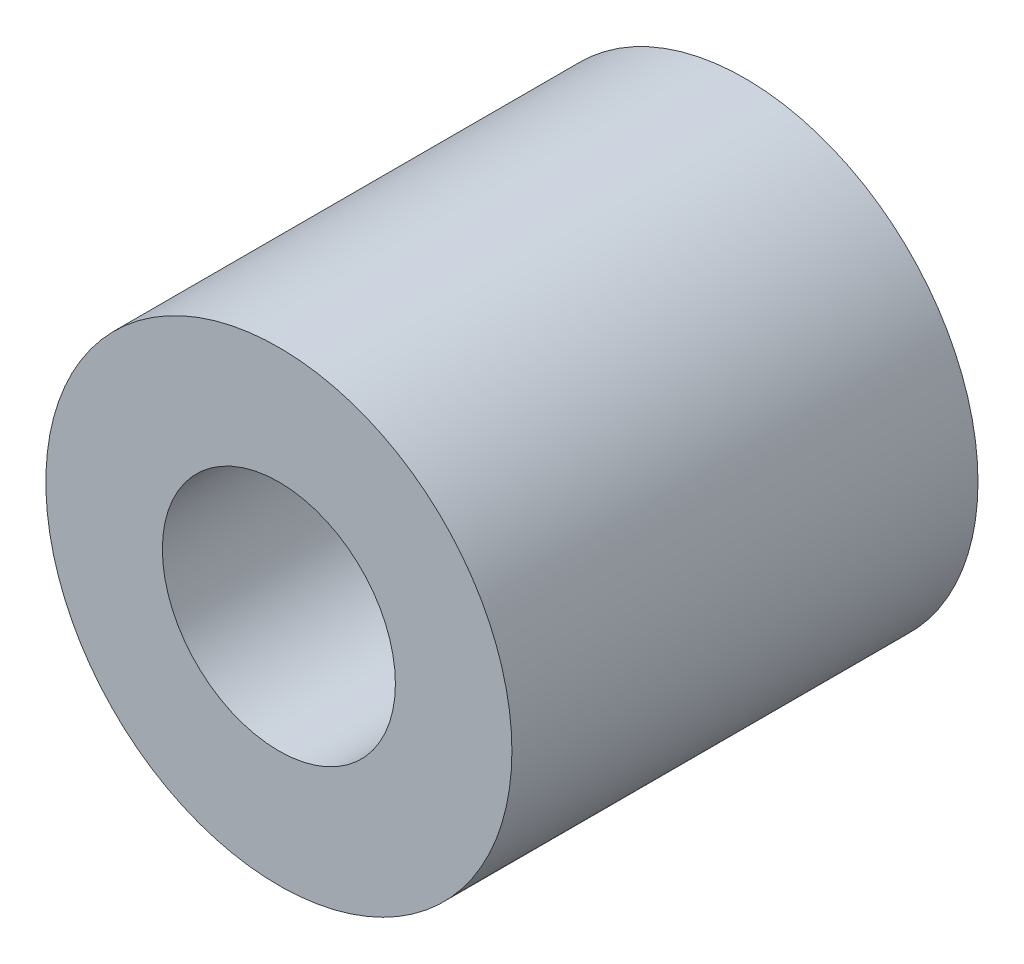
ISO-10303-21;
HEADER;
FILE_DESCRIPTION(('STEP AP214'),'2;1');
FILE_NAME('part.step','',(''),(''),'','','');
FILE_SCHEMA(('AUTOMOTIVE_DESIGN { 1 0 10303 214 1 1 1 1 }'));
ENDSEC;
DATA;
#1=APPLICATION_CONTEXT('core data for automotive mechanical design processes');
#2=APPLICATION_PROTOCOL_DEFINITION('international standard','automotive_design',2000,#1);
#3=PRODUCT_CONTEXT('',#1,'mechanical');
#4=PRODUCT('Part','Part','',(#3));
#5=PRODUCT_RELATED_PRODUCT_CATEGORY('part','',(#4));
#6=PRODUCT_DEFINITION_FORMATION('','',#4);
#7=PRODUCT_DEFINITION_CONTEXT('part definition',#1,'design');
#8=PRODUCT_DEFINITION('design','',#6,#7);
#9=PRODUCT_DEFINITION_SHAPE('','',#8);
#10=(LENGTH_UNIT() NAMED_UNIT(*) SI_UNIT(.MILLI.,.METRE.));
#11=(NAMED_UNIT(*) PLANE_ANGLE_UNIT() SI_UNIT($,.RADIAN.));
#12=(NAMED_UNIT(*) SI_UNIT($,.STERADIAN.) SOLID_ANGLE_UNIT());
#13=UNCERTAINTY_MEASURE_WITH_UNIT(LENGTH_MEASURE(1.E-05),#10,'distance_accuracy_value','');
#14=(GEOMETRIC_REPRESENTATION_CONTEXT(3) GLOBAL_UNCERTAINTY_ASSIGNED_CONTEXT((#13)) GLOBAL_UNIT_ASSIGNED_CONTEXT((#10,
#11,#12)) REPRESENTATION_CONTEXT('',''));
#15=CARTESIAN_POINT('',(0.,0.,0.));
#16=DIRECTION('',(0.,0.,1.));
#17=DIRECTION('',(1.,0.,0.));
#18=AXIS2_PLACEMENT_3D('',#15,#16,#17);
#19=CARTESIAN_POINT('',(0.,0.,6.));
#20=DIRECTION('',(0.,0.,1.));
#21=DIRECTION('',(1.,0.,0.));
#22=AXIS2_PLACEMENT_3D('',#19,#20,#21);
#23=PLANE('',#22);
#24=CARTESIAN_POINT('',(0.,0.,6.));
#25=DIRECTION('',(0.,0.,1.));
#26=DIRECTION('',(1.,0.,0.));
#27=AXIS2_PLACEMENT_3D('',#24,#25,#26);
#28=CIRCLE('',#27,3.);
#29=CARTESIAN_POINT('',(3.,0.,6.));
#30=VERTEX_POINT('',#29);
#31=EDGE_CURVE('E10',#30,#30,#28,.T.);
#32=ORIENTED_EDGE('',*,*,#31,.T.);
#33=EDGE_LOOP('',(#32));
#34=FACE_BOUND('',#33,.T.);
#35=CARTESIAN_POINT('',(0.,0.,6.));
#36=DIRECTION('',(0.,0.,1.));
#37=DIRECTION('',(1.,0.,0.));
#38=AXIS2_PLACEMENT_3D('',#35,#36,#37);
#39=CIRCLE('',#38,1.5);
#40=CARTESIAN_POINT('',(1.5,0.,6.));
#41=VERTEX_POINT('',#40);
#42=EDGE_CURVE('E45',#41,#41,#39,.T.);
#43=ORIENTED_EDGE('',*,*,#42,.F.);
#44=EDGE_LOOP('',(#43));
#45=FACE_BOUND('',#44,.T.);
#46=ADVANCED_FACE('F34',(#34,#45),#23,.T.);
#47=CARTESIAN_POINT('',(0.,0.,0.));
#48=DIRECTION('',(0.,0.,1.));
#49=DIRECTION('',(1.,0.,0.));
#50=AXIS2_PLACEMENT_3D('',#47,#48,#49);
#51=PLANE('',#50);
#52=CARTESIAN_POINT('',(0.,0.,0.));
#53=DIRECTION('',(0.,0.,1.));
#54=DIRECTION('',(1.,0.,0.));
#55=AXIS2_PLACEMENT_3D('',#52,#53,#54);
#56=CIRCLE('',#55,3.);
#57=CARTESIAN_POINT('',(3.,0.,0.));
#58=VERTEX_POINT('',#57);
#59=EDGE_CURVE('E41',#58,#58,#56,.T.);
#60=ORIENTED_EDGE('',*,*,#59,.F.);
#61=EDGE_LOOP('',(#60));
#62=FACE_BOUND('',#61,.T.);
#63=CARTESIAN_POINT('',(0.,0.,0.));
#64=DIRECTION('',(0.,0.,1.));
#65=DIRECTION('',(1.,0.,0.));
#66=AXIS2_PLACEMENT_3D('',#63,#64,#65);
#67=CIRCLE('',#66,1.5);
#68=CARTESIAN_POINT('',(1.5,0.,0.));
#69=VERTEX_POINT('',#68);
#70=EDGE_CURVE('E49',#69,#69,#67,.T.);
#71=ORIENTED_EDGE('',*,*,#70,.T.);
#72=EDGE_LOOP('',(#71));
#73=FACE_BOUND('',#72,.T.);
#74=ADVANCED_FACE('F55',(#62,#73),#51,.F.);
#75=CARTESIAN_POINT('',(0.,0.,6.));
#76=DIRECTION('',(0.,0.,-1.));
#77=DIRECTION('',(-1.,0.,0.));
#78=AXIS2_PLACEMENT_3D('',#75,#76,#77);
#79=CYLINDRICAL_SURFACE('',#78,3.);
#80=ORIENTED_EDGE('',*,*,#31,.F.);
#81=EDGE_LOOP('',(#80));
#82=FACE_BOUND('',#81,.T.);
#83=ORIENTED_EDGE('',*,*,#59,.T.);
#84=EDGE_LOOP('',(#83));
#85=FACE_BOUND('',#84,.T.);
#86=ADVANCED_FACE('F36',(#82,#85),#79,.T.);
#87=CARTESIAN_POINT('',(0.,0.,6.));
#88=DIRECTION('',(0.,0.,-1.));
#89=DIRECTION('',(-1.,0.,0.));
#90=AXIS2_PLACEMENT_3D('',#87,#88,#89);
#91=CYLINDRICAL_SURFACE('',#90,1.5);
#92=ORIENTED_EDGE('',*,*,#42,.T.);
#93=EDGE_LOOP('',(#92));
#94=FACE_BOUND('',#93,.T.);
#95=ORIENTED_EDGE('',*,*,#70,.F.);
#96=EDGE_LOOP('',(#95));
#97=FACE_BOUND('',#96,.T.);
#98=ADVANCED_FACE('F57',(#94,#97),#91,.F.);
#99=CLOSED_SHELL('',(#46,#74,#86,#98));
#100=MANIFOLD_SOLID_BREP('B2',#99);
#101=ADVANCED_BREP_SHAPE_REPRESENTATION('',(#18,#100),#14);
#102=SHAPE_DEFINITION_REPRESENTATION(#9,#101);
ENDSEC;
END-ISO-10303-21;
